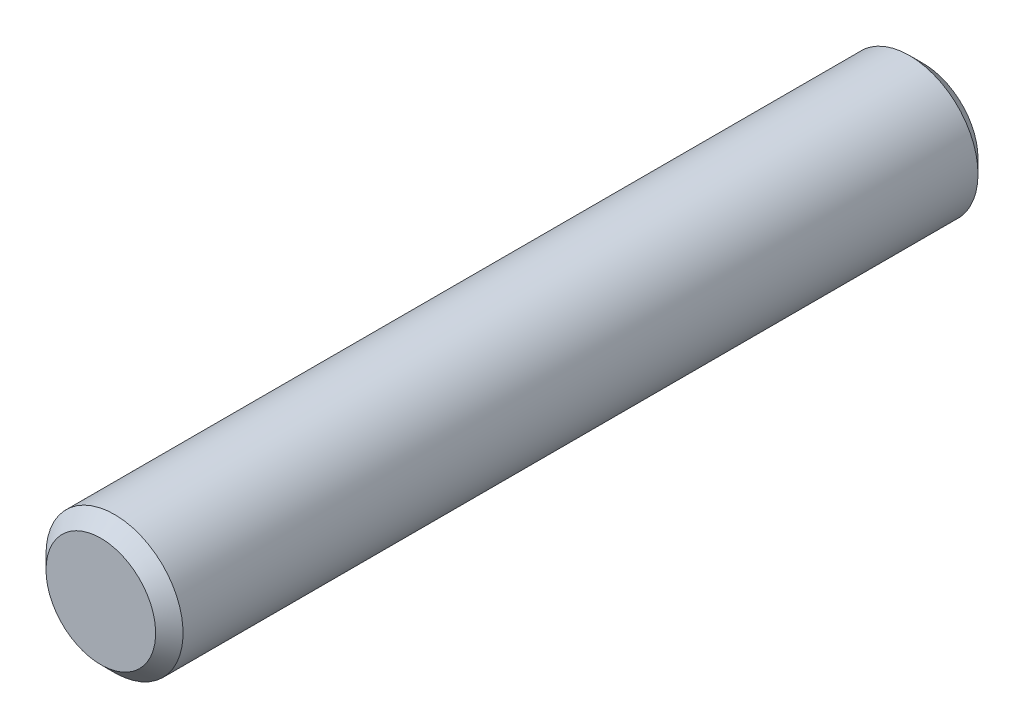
from build123d import *

# Parameters (mm, degrees)
SKETCH1_R      = 3.175
EXTRUDE1_DEPTH = 19.05
CHAMFER1_SIZE  = 0.635


with BuildPart() as part:
    # Sketch1 → Extrude1 (new, symmetric)
    with BuildSketch(Plane.XY):
        with Locations(Location((0, 0, 0), (0, 0, 180))):
            Circle(SKETCH1_R)
    extrude(amount=EXTRUDE1_DEPTH, both=True)

    # Chamfer1
    chamfer1_edges = [part.edges().sort_by_distance(p)[0] for p in [
        (3.175, 0, -19.05),
        (3.175, 0, 19.05),
    ]]
    chamfer(chamfer1_edges, length=CHAMFER1_SIZE)


solid = part.part
